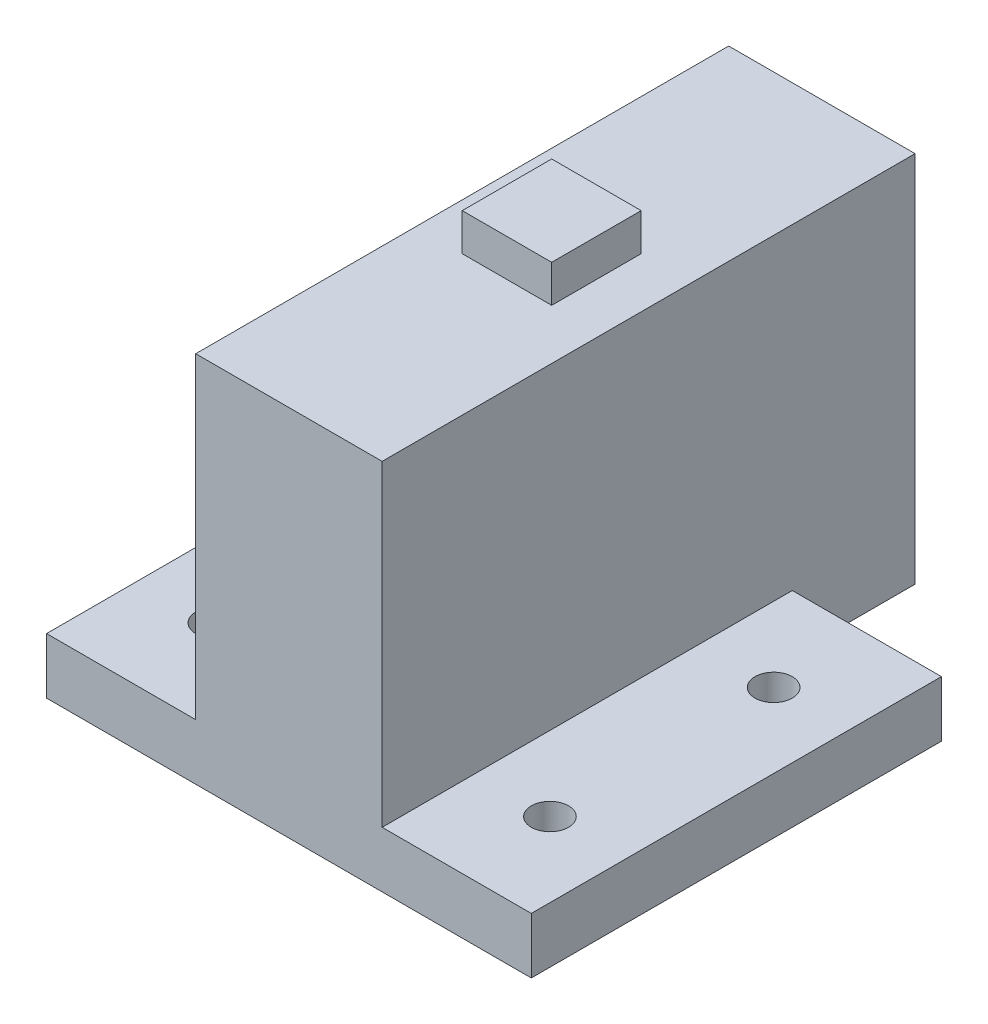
from build123d import *

# Parameters (mm, degrees)
SKETCH1_W                = 50
SKETCH1_H                = 150
BOSS_EXTRUDE1_DEPTH      = 250
SKETCH2_R                = 52.5
CUT_EXTRUDE1_DEPTH       = 15
BOSS_EXTRUDE2_DEPTH      = 150
BOSS_EXTRUDE3_DEPTH      = 175
SKETCH10_W               = 49.988184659
SKETCH10_H               = 250
BOSS_EXTRUDE4_DEPTH      = 200
CUT_EXTRUDE4_DEPTH       = 471.132959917
SKETCH12_W               = 200
SKETCH12_H               = 49.988184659
CUT_EXTRUDE5_DEPTH       = 55
CUT_EXTRUDE8_DEPTH       = 20
SKETCH17_W               = 12.5
SKETCH17_H               = 10.5
CUT_EXTRUDE9_DEPTH       = 9
SKETCH20_R               = 54.5
CUT_EXTRUDE10_DEPTH      = 10
SKETCH21_W               = 182.056865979
SKETCH21_H               = 55
CUT_EXTRUDE11_DEPTH      = 457.207189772
SKETCH24_W               = 16.5
SKETCH24_H               = 16.5
CUT_EXTRUDE13_DEPTH      = 50
SKETCH25_W               = 16.5
SKETCH25_H               = 22
CUT_EXTRUDE14_DEPTH      = 50
SKETCH26_W               = 16.5
SKETCH26_H               = 6.313729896
CUT_EXTRUDE15_DEPTH      = 50
CUT_EXTRUDE16_START      = -71.75
CUT_EXTRUDE16_DEPTH      = 29
SKETCH29_W               = 12.5
SKETCH29_H               = 10.5
CUT_EXTRUDE18_DEPTH      = 9
SKETCH30_W               = 40.672773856
SKETCH30_H               = 32.854304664
CUT_EXTRUDE19_DEPTH      = 50
SKETCH31_R               = 3.5
CUT_EXTRUDE20_DEPTH      = 20
CUT_EXTRUDE21_DEPTH      = 33
SKETCH33_R               = 63
SKETCH33_R_2             = 60
CUT_EXTRUDE22_DEPTH      = 20
SKETCH34_W               = 321
SKETCH34_H               = 90
CUT_EXTRUDE23_DEPTH      = 300
CUT_EXTRUDE24_DEPTH      = 358.678093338
CUT_EXTRUDE24_DEPTH_BACK = 358.678093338
SKETCH35_W               = 71
SKETCH35_H               = 235
SKETCH35_W_2             = 71.037708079
BOSS_EXTRUDE5_START      = -155
SKETCH36_W               = 50
SKETCH36_H               = 45
BOSS_EXTRUDE5_DEPTH      = 40
SKETCH38_W               = 110
SKETCH38_H               = 15
BOSS_EXTRUDE6_DEPTH      = 40
SKETCH39_W               = 110
SKETCH39_H               = 15
BOSS_EXTRUDE7_DEPTH      = 40
CUT_EXTRUDE25_DEPTH      = 342.833292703
CUT_EXTRUDE25_DEPTH_BACK = 342.833292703
SKETCH40_R               = 5
SKETCH41_W               = 20.15
SKETCH41_H               = 20.15
CUT_EXTRUDE26_DEPTH      = 31.5
CUT_EXTRUDE27_DEPTH      = 75
CUT_EXTRUDE27_DEPTH_BACK = 70
SKETCH43_W               = 92.056865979
SKETCH43_H               = 195
CUT_EXTRUDE28_DEPTH      = 41
CUT_EXTRUDE28_DEPTH_BACK = 62
SKETCH44_W               = 142.943134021
SKETCH44_H               = 150
SKETCH45_W               = 24
SKETCH45_H               = 24
BOSS_EXTRUDE8_DEPTH      = 10
SKETCH46_W               = 25
SKETCH46_H               = 25
CUT_EXTRUDE29_DEPTH      = 10


with BuildPart() as part:
    # Sketch1 → Boss-Extrude1 (new body)
    with BuildSketch(Plane(origin=(0, 0, 0), x_dir=(1, 0, 0), z_dir=(0, 1, 0))):
        with Locations((5, 75)):
            Rectangle(SKETCH1_W, SKETCH1_H)
    extrude(amount=BOSS_EXTRUDE1_DEPTH)

    # Sketch2 → Cut-Extrude1 (cut)
    with BuildSketch(Plane(origin=(30, 0, 0), x_dir=(0, 0, -1), z_dir=(1, 0, 0))):
        with Locations((75, 175)):
            Circle(SKETCH2_R)
    extrude(amount=-CUT_EXTRUDE1_DEPTH, mode=Mode.SUBTRACT)

    # Sketch4 → Boss-Extrude2 (add)
    with BuildSketch(Plane.XY):
        with BuildLine():
            Line((30, 0), (30, 62.5))
            ThreePointArc((30, 62.5), (53.728602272, 17.849160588), (101.037708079, 0))
            Line((101.037708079, 0), (30, 0))
        make_face()
        with BuildLine():
            Line((-20, 0), (-91, 0))
            ThreePointArc((-91, 0), (-43.705047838, 17.850934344), (-20, 62.5))
            Line((-20, 62.5), (-20, 0))
        make_face()
    extrude(amount=-BOSS_EXTRUDE2_DEPTH)

    # Sketch8 → Boss-Extrude3 (add)
    with BuildSketch(Plane(origin=(0, 0, -150), x_dir=(-1, 0, 0), z_dir=(0, 0, -1))):
        with BuildLine():
            Line((-30, 250), (-30, 62.5))
            ThreePointArc((-30, 62.5), (-53.728602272, 17.849160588), (-101.037708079, 0))
            Line((-101.037708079, 0), (91, 0))
            ThreePointArc((91, 0), (43.705047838, 17.850934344), (20, 62.5))
            Line((20, 62.5), (20, 250))
            Line((20, 250), (-30, 250))
        make_face()
    extrude(amount=BOSS_EXTRUDE3_DEPTH)

    # Sketch10 → Boss-Extrude4 (add)
    with BuildSketch(Plane(origin=(30, 0, 0), x_dir=(0, 0, -1), z_dir=(1, 0, 0))):
        with Locations((300.005907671, 125)):
            Rectangle(SKETCH10_W, SKETCH10_H)
    extrude(amount=BOSS_EXTRUDE4_DEPTH)

    # Sketch11 → Cut-Extrude4 (cut, through all)
    with BuildSketch(Plane(origin=(0, 0, -325), x_dir=(-1, 0, 0), z_dir=(0, 0, -1))):
        Polygon((-166.5, 175), (-135.5, 175), (-135.5, 154), (-197.5, 154), (-197.5, 175), align=None)
    extrude(amount=-CUT_EXTRUDE4_DEPTH, mode=Mode.SUBTRACT)

    # Sketch12 → Cut-Extrude5 (cut)
    with BuildSketch(Plane(origin=(0, 250, 0), x_dir=(1, 0, 0), z_dir=(0, 1, 0))):
        with Locations((130, 300.005907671)):
            Rectangle(SKETCH12_W, SKETCH12_H)
    extrude(amount=-CUT_EXTRUDE5_DEPTH, mode=Mode.SUBTRACT)

    # Sketch16 → Cut-Extrude8 (cut)
    with BuildSketch(Plane(origin=(15, 0, 0), x_dir=(0, 0, -1), z_dir=(1, 0, 0))):
        with BuildLine():
            Line((71.75, 180), (78.25, 180))
            add(Edge.make_bspline(
                [(78.25, 170), (84.285140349, 175), (78.25, 180)],
                knots=[0, 0, 0, 1, 1, 1], degree=2))
            Line((78.25, 170), (71.75, 170))
            add(Edge.make_bspline(
                [(71.75, 180), (66.057994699, 175), (71.75, 170)],
                knots=[0, 0, 0, 1, 1, 1], degree=2))
        make_face()
    extrude(amount=-CUT_EXTRUDE8_DEPTH, mode=Mode.SUBTRACT)

    # Sketch17 → Cut-Extrude9 (cut)
    with BuildSketch(Plane(origin=(15, 0, 0), x_dir=(0, 0, -1), z_dir=(1, 0, 0))):
        with Locations((75.068297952, 175)):
            Rectangle(SKETCH17_W, SKETCH17_H)
    extrude(amount=-CUT_EXTRUDE9_DEPTH, mode=Mode.SUBTRACT)

    # Sketch20 → Cut-Extrude10 (cut)
    with BuildSketch(Plane(origin=(30, 0, 0), x_dir=(0, 0, -1), z_dir=(1, 0, 0))):
        with Locations((75, 175)):
            Circle(SKETCH20_R)
    extrude(amount=-CUT_EXTRUDE10_DEPTH, mode=Mode.SUBTRACT)

    # Sketch21 → Cut-Extrude11 (cut, through all)
    with BuildSketch(Plane(origin=(30, 0, 0), x_dir=(0, 0, -1), z_dir=(1, 0, 0))):
        with Locations((233.97156701, 222.5)):
            Rectangle(SKETCH21_W, SKETCH21_H)
    extrude(amount=-CUT_EXTRUDE11_DEPTH, mode=Mode.SUBTRACT)

    # Sketch24 → Cut-Extrude13 (cut)
    with BuildSketch(Plane.XY.offset(-275.011815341)):
        with Locations((166.5, 145.75)):
            Rectangle(SKETCH24_W, SKETCH24_H)
    extrude(amount=-CUT_EXTRUDE13_DEPTH, mode=Mode.SUBTRACT)

    # Sketch25 → Cut-Extrude14 (cut)
    with BuildSketch(Plane.XY.offset(-275.011815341)):
        with Locations((166.5, 120.186270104)):
            Rectangle(SKETCH25_W, SKETCH25_H)
    extrude(amount=-CUT_EXTRUDE14_DEPTH, mode=Mode.SUBTRACT)

    # Sketch26 → Cut-Extrude15 (cut)
    with BuildSketch(Plane.XY.offset(-275.011815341)):
        with Locations((166.5, 134.343135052)):
            Rectangle(SKETCH26_W, SKETCH26_H)
    extrude(amount=-CUT_EXTRUDE15_DEPTH, mode=Mode.SUBTRACT)

    # Sketch27 → Cut-Extrude16 (cut)
    with BuildSketch(Plane(origin=(230, 0, 0), x_dir=(0, 0, -1), z_dir=(1, 0, 0)).offset(CUT_EXTRUDE16_START)):
        with BuildLine():
            Line((291.501152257, 135.100374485), (298.001152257, 135.100374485))
            add(Edge.make_bspline(
                [(298.001152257, 125.100374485), (303.344461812, 130.207776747), (298.001152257, 135.100374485)],
                knots=[0, 0, 0, 1, 1, 1], degree=2))
            Line((298.001152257, 125.100374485), (291.501152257, 125.100374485))
            add(Edge.make_bspline(
                [(291.501152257, 135.100374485), (285.456075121, 130.207776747), (291.501152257, 125.100374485)],
                knots=[0, 0, 0, 1, 1, 1], degree=2))
        make_face()
    extrude(amount=-CUT_EXTRUDE16_DEPTH, mode=Mode.SUBTRACT)

    # Sketch29 → Cut-Extrude18 (cut)
    with BuildSketch(Plane(origin=(158.25, 0, 0), x_dir=(0, 0, -1), z_dir=(1, 0, 0))):
        with Locations((294.582313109, 130.149892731)):
            Rectangle(SKETCH29_W, SKETCH29_H)
        with BuildLine():
            Line((298.001152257, 135.100374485), (291.501152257, 135.100374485))
            add(Edge.make_bspline(
                [(291.501152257, 135.100374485), (285.456075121, 130.207776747), (291.501152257, 125.100374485)],
                knots=[0, 0, 0, 1, 1, 1], degree=2))
            Line((291.501152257, 125.100374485), (298.001152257, 125.100374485))
            add(Edge.make_bspline(
                [(298.001152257, 125.100374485), (303.344461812, 130.207776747), (298.001152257, 135.100374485)],
                knots=[0, 0, 0, 1, 1, 1], degree=2))
        make_face(mode=Mode.SUBTRACT)
    extrude(amount=-CUT_EXTRUDE18_DEPTH, mode=Mode.SUBTRACT)

    # Sketch30 → Cut-Extrude19 (cut)
    with BuildSketch(Plane.XY.offset(-275.011815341)):
        with Locations((178.586386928, 125.602490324)):
            Rectangle(SKETCH30_W, SKETCH30_H)
    extrude(amount=-CUT_EXTRUDE19_DEPTH, mode=Mode.SUBTRACT)

    # Sketch31 → Cut-Extrude20 (cut)
    with BuildSketch(Plane(origin=(-5, 0, 0), x_dir=(0, 0, -1), z_dir=(1, 0, 0))):
        with Locations((74.950457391, 175.071160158)):
            Circle(SKETCH31_R)
    extrude(amount=-CUT_EXTRUDE20_DEPTH, mode=Mode.SUBTRACT)

    # Sketch32 → Cut-Extrude21 (cut)
    with BuildSketch(Plane(origin=(0, 0, -325), x_dir=(-1, 0, 0), z_dir=(0, 0, -1))):
        with BuildLine():
            ThreePointArc((-128.116356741, 129.990231), (-128.41227742, 131.398732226), (-129.25, 132.569059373))
            Line((-129.25, 132.569059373), (-129.25, 127.411402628))
            ThreePointArc((-129.25, 127.411402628), (-128.41227742, 128.581729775), (-128.116356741, 129.990231))
        make_face()
        with BuildLine():
            Line((-129.25, 127.411402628), (-129.25, 132.569059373))
            ThreePointArc((-129.25, 132.569059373), (-135.116356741, 129.990231), (-129.25, 127.411402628))
        make_face()
    extrude(amount=-CUT_EXTRUDE21_DEPTH, mode=Mode.SUBTRACT)

    # Sketch33 → Cut-Extrude22 (cut)
    with BuildSketch(Plane(origin=(30, 0, 0), x_dir=(0, 0, -1), z_dir=(1, 0, 0))):
        with Locations((74.950457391, 175.071160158)):
            Circle(SKETCH33_R)
        with Locations((74.950457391, 175.071160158)):
            Circle(SKETCH33_R_2, mode=Mode.SUBTRACT)
    extrude(amount=-CUT_EXTRUDE22_DEPTH, mode=Mode.SUBTRACT)

    # Sketch34 → Cut-Extrude23 (cut)
    with BuildSketch(Plane(origin=(0, 195, 0), x_dir=(1, 0, 0), z_dir=(0, 1, 0))):
        with Locations((69.5, 280)):
            Rectangle(SKETCH34_W, SKETCH34_H)
    extrude(amount=-CUT_EXTRUDE23_DEPTH, mode=Mode.SUBTRACT)

    # Sketch35 → Cut-Extrude24 (cut, two sides: drawn at the far end of the back side and taken through both)
    with BuildSketch(Plane(origin=(0, 250, 0), x_dir=(1, 0, 0), z_dir=(0, 1, 0)).offset(-CUT_EXTRUDE24_DEPTH_BACK)):
        with Locations((-55.5, 117.5)):
            Rectangle(SKETCH35_W, SKETCH35_H)
        with Locations((65.51885404, 117.5)):
            Rectangle(SKETCH35_W_2, SKETCH35_H)
    extrude(amount=CUT_EXTRUDE24_DEPTH + CUT_EXTRUDE24_DEPTH_BACK, mode=Mode.SUBTRACT)

    # Sketch36 → Boss-Extrude5 (add)
    with BuildSketch(Plane(origin=(0, 195, 0), x_dir=(1, 0, 0), z_dir=(0, 1, 0)).offset(BOSS_EXTRUDE5_START)):
        with Locations((55, 212.5)):
            Rectangle(SKETCH36_W, SKETCH36_H)
    extrude(amount=-BOSS_EXTRUDE5_DEPTH)

    # Sketch38 → Boss-Extrude6 (add)
    with BuildSketch(Plane(origin=(30, 0, 0), x_dir=(0, 0, -1), z_dir=(1, 0, 0))):
        with Locations((55, 7.5)):
            Rectangle(SKETCH38_W, SKETCH38_H)
    extrude(amount=BOSS_EXTRUDE6_DEPTH)

    # Sketch39 → Boss-Extrude7 (add)
    with BuildSketch(Plane.ZY.offset(20)):
        with Locations((-55, 7.5)):
            Rectangle(SKETCH39_W, SKETCH39_H)
    extrude(amount=BOSS_EXTRUDE7_DEPTH)

    # Sketch40 → Cut-Extrude25 (cut, two sides: drawn at the far end of the back side and taken through both)
    with BuildSketch(Plane(origin=(0, 15, 0), x_dir=(1, 0, 0), z_dir=(0, 1, 0)).offset(-CUT_EXTRUDE25_DEPTH_BACK)):
        with Locations(Location((-40, 85, 0), (0, 0, 270))):
            Circle(SKETCH40_R)
        with Locations(Location((-40, 25, 0), (0, 0, 270))):
            Circle(SKETCH40_R)
        with Locations(Location((50, 85, 0), (0, 0, 270))):
            Circle(SKETCH40_R)
        with Locations(Location((50, 25, 0), (0, 0, 270))):
            Circle(SKETCH40_R)
    extrude(amount=CUT_EXTRUDE25_DEPTH + CUT_EXTRUDE25_DEPTH_BACK, mode=Mode.SUBTRACT)

    # Sketch41 → Cut-Extrude26 (cut)
    with BuildSketch(Plane(origin=(0, 0, -235), x_dir=(-1, 0, 0), z_dir=(0, 0, -1))):
        with Locations((-5, 152)):
            Rectangle(SKETCH41_W, SKETCH41_H)
        with Locations((-5, 99)):
            Rectangle(SKETCH41_W, SKETCH41_H)
        with Locations((-5, 46)):
            Rectangle(SKETCH41_W, SKETCH41_H)
        with Locations((-52, 20)):
            Rectangle(SKETCH41_W, SKETCH41_H)
    extrude(amount=-CUT_EXTRUDE26_DEPTH, mode=Mode.SUBTRACT)

    # Sketch43 → Cut-Extrude27 (cut, two sides: drawn at the far end of the back side and taken through both)
    with BuildSketch(Plane(origin=(30, 0, 0), x_dir=(0, 0, -1), z_dir=(1, 0, 0)).offset(-CUT_EXTRUDE27_DEPTH_BACK)):
        with Locations((188.971567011, 97.5)):
            Rectangle(SKETCH43_W, SKETCH43_H)
    extrude(amount=CUT_EXTRUDE27_DEPTH + CUT_EXTRUDE27_DEPTH_BACK, mode=Mode.SUBTRACT)

    # Sketch44 → Cut-Extrude28 (cut, two sides: drawn at the far end of the back side and taken through both)
    with BuildSketch(Plane(origin=(30, 0, 0), x_dir=(0, 0, -1), z_dir=(1, 0, 0)).offset(-CUT_EXTRUDE28_DEPTH_BACK)):
        with Locations((71.471567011, 175)):
            Rectangle(SKETCH44_W, SKETCH44_H)
    extrude(amount=CUT_EXTRUDE28_DEPTH + CUT_EXTRUDE28_DEPTH_BACK, mode=Mode.SUBTRACT)

    # Sketch45 → Boss-Extrude8 (add)
    with BuildSketch(Plane(origin=(0, 100, 0), x_dir=(1, 0, 0), z_dir=(0, 1, 0))):
        with Locations((4.5, 70.97156701)):
            Rectangle(SKETCH45_W, SKETCH45_H)
    extrude(amount=BOSS_EXTRUDE8_DEPTH)

    # Sketch46 → Cut-Extrude29 (cut)
    with BuildSketch(Plane(origin=(0, 0, -142.943134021), x_dir=(-1, 0, 0), z_dir=(0, 0, -1))):
        with Locations((-5, 50)):
            Rectangle(SKETCH46_W, SKETCH46_H)
    extrude(amount=-CUT_EXTRUDE29_DEPTH, mode=Mode.SUBTRACT)


solid = part.part
